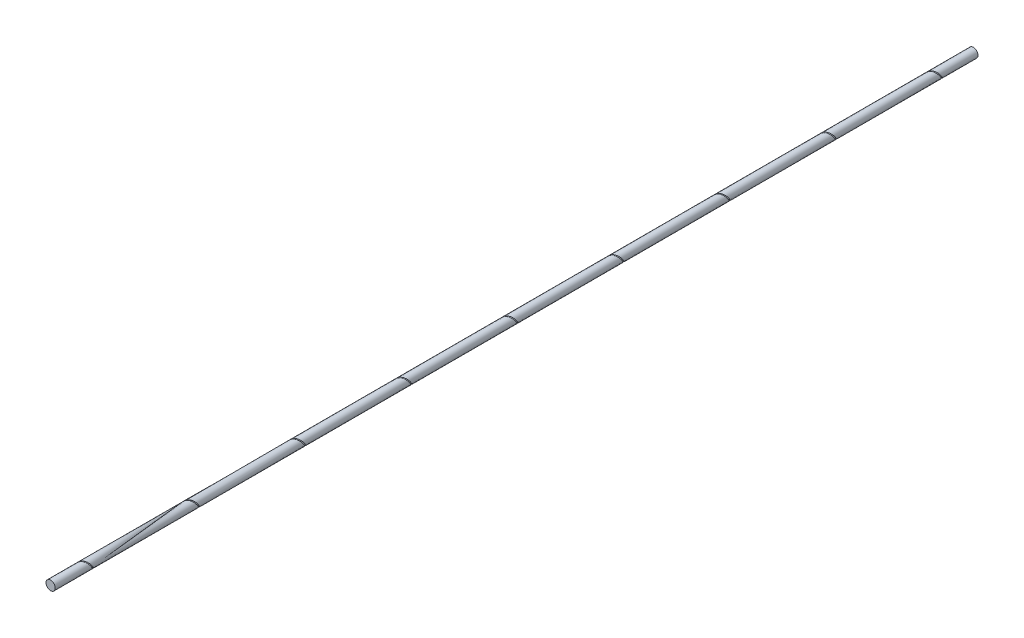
from build123d import *

# Parameters (mm, degrees)
SKETCH1_R              = 25
BOSS_EXTRUDE1_DEPTH    = 5000
CUT_SWEEP1_PITCH       = 100
CUT_SWEEP1_HEIGHT      = 100
CUT_SWEEP1_RADIUS      = 27.646
CUT_SWEEP1_START_ANGLE = -180
SKETCH3_R              = 3.969
LPATTERN1_COUNT        = 9
LPATTERN1_PITCH        = 575


with BuildPart() as part:
    # Sketch1 → Boss-Extrude1 (new body)
    with BuildSketch(Plane.XY):
        Circle(SKETCH1_R)
    extrude(amount=BOSS_EXTRUDE1_DEPTH)

    # Cut-Sweep1: sweep along a helix
    with BuildLine() as cut_sweep1_path:
        add(Helix(CUT_SWEEP1_PITCH, CUT_SWEEP1_HEIGHT, CUT_SWEEP1_RADIUS, center=(0, 0, 150), direction=(0, 0, 1), mode=Mode.PRIVATE).rotate(Axis((0, 0, 150), (0, 0, 1)), CUT_SWEEP1_START_ANGLE))
    # Sketch3 → Cut-Sweep1 (sweep, cut)
    with BuildSketch(Plane(origin=(0, 0, 0), x_dir=(1, 0, 0), z_dir=(0, 1, 0))):
        with Locations((-27.646, -150)):
            Circle(SKETCH3_R)
    cut_sweep1 = sweep(path=cut_sweep1_path.line, is_frenet=True, mode=Mode.SUBTRACT)

    # LPattern1: Cut-Sweep1 ×9
    with Locations(*[(0, 0, i * LPATTERN1_PITCH) for i in range(1, LPATTERN1_COUNT)]):
        add(cut_sweep1, mode=Mode.SUBTRACT)


solid = part.part
